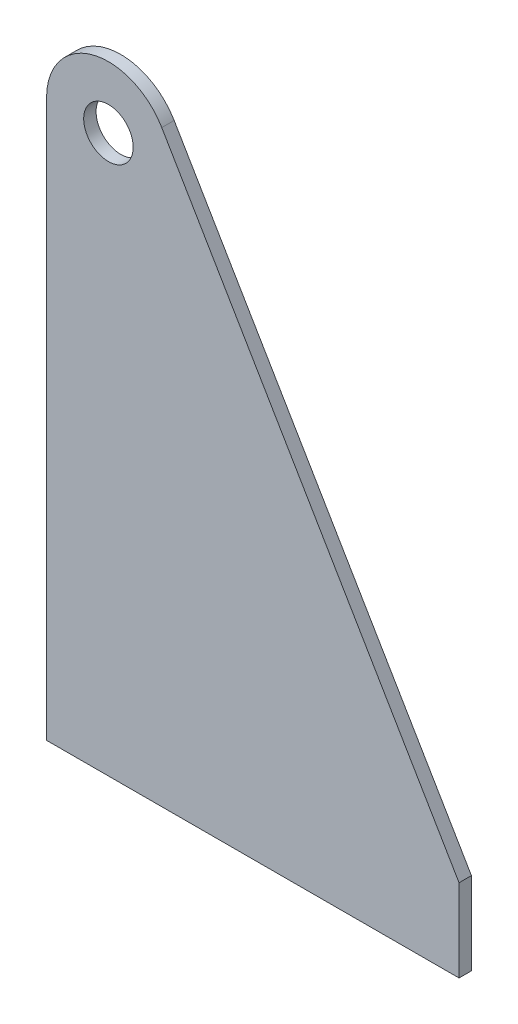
ISO-10303-21;
HEADER;
FILE_DESCRIPTION(('STEP AP214'),'2;1');
FILE_NAME('part.step','',(''),(''),'','','');
FILE_SCHEMA(('AUTOMOTIVE_DESIGN { 1 0 10303 214 1 1 1 1 }'));
ENDSEC;
DATA;
#1=APPLICATION_CONTEXT('core data for automotive mechanical design processes');
#2=APPLICATION_PROTOCOL_DEFINITION('international standard','automotive_design',2000,#1);
#3=PRODUCT_CONTEXT('',#1,'mechanical');
#4=PRODUCT('Part','Part','',(#3));
#5=PRODUCT_RELATED_PRODUCT_CATEGORY('part','',(#4));
#6=PRODUCT_DEFINITION_FORMATION('','',#4);
#7=PRODUCT_DEFINITION_CONTEXT('part definition',#1,'design');
#8=PRODUCT_DEFINITION('design','',#6,#7);
#9=PRODUCT_DEFINITION_SHAPE('','',#8);
#10=(LENGTH_UNIT() NAMED_UNIT(*) SI_UNIT(.MILLI.,.METRE.));
#11=(NAMED_UNIT(*) PLANE_ANGLE_UNIT() SI_UNIT($,.RADIAN.));
#12=(NAMED_UNIT(*) SI_UNIT($,.STERADIAN.) SOLID_ANGLE_UNIT());
#13=UNCERTAINTY_MEASURE_WITH_UNIT(LENGTH_MEASURE(1.E-05),#10,'distance_accuracy_value','');
#14=(GEOMETRIC_REPRESENTATION_CONTEXT(3) GLOBAL_UNCERTAINTY_ASSIGNED_CONTEXT((#13)) GLOBAL_UNIT_ASSIGNED_CONTEXT((#10,
#11,#12)) REPRESENTATION_CONTEXT('',''));
#15=CARTESIAN_POINT('',(0.,0.,0.));
#16=DIRECTION('',(0.,0.,1.));
#17=DIRECTION('',(1.,0.,0.));
#18=AXIS2_PLACEMENT_3D('',#15,#16,#17);
#19=CARTESIAN_POINT('',(609.61263645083,922.018228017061,3.));
#20=DIRECTION('',(0.,0.,1.));
#21=DIRECTION('',(1.,0.,0.));
#22=AXIS2_PLACEMENT_3D('',#19,#20,#21);
#23=PLANE('',#22);
#24=DIRECTION('',(-0.507040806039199,0.861922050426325,0.));
#25=VECTOR('',#24,1.);
#26=CARTESIAN_POINT('',(622.541467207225,929.623840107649,3.));
#27=LINE('',#26,#25);
#28=CARTESIAN_POINT('',(694.612578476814,807.10967702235,3.));
#29=VERTEX_POINT('',#28);
#30=CARTESIAN_POINT('',(622.541467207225,929.623840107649,3.));
#31=VERTEX_POINT('',#30);
#32=EDGE_CURVE('E102',#29,#31,#27,.T.);
#33=ORIENTED_EDGE('',*,*,#32,.T.);
#34=CARTESIAN_POINT('',(609.61263645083,922.018228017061,3.));
#35=DIRECTION('',(0.,0.,1.));
#36=DIRECTION('',(1.,0.,0.));
#37=AXIS2_PLACEMENT_3D('',#34,#35,#36);
#38=CIRCLE('',#37,15.);
#39=CARTESIAN_POINT('',(594.61263645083,922.018228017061,3.));
#40=VERTEX_POINT('',#39);
#41=EDGE_CURVE('E85',#31,#40,#38,.T.);
#42=ORIENTED_EDGE('',*,*,#41,.T.);
#43=DIRECTION('',(0.,-1.,0.));
#44=VECTOR('',#43,1.);
#45=CARTESIAN_POINT('',(594.61263645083,922.018228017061,3.));
#46=LINE('',#45,#44);
#47=CARTESIAN_POINT('',(594.61263645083,787.001997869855,3.));
#48=VERTEX_POINT('',#47);
#49=EDGE_CURVE('E105',#40,#48,#46,.T.);
#50=ORIENTED_EDGE('',*,*,#49,.T.);
#51=DIRECTION('',(0.999999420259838,0.00107679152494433,0.));
#52=VECTOR('',#51,1.);
#53=CARTESIAN_POINT('',(694.612578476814,787.10967702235,3.));
#54=LINE('',#53,#52);
#55=CARTESIAN_POINT('',(694.612578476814,787.10967702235,3.));
#56=VERTEX_POINT('',#55);
#57=EDGE_CURVE('E44',#48,#56,#54,.T.);
#58=ORIENTED_EDGE('',*,*,#57,.T.);
#59=DIRECTION('',(0.,1.,0.));
#60=VECTOR('',#59,1.);
#61=CARTESIAN_POINT('',(694.612578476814,807.10967702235,3.));
#62=LINE('',#61,#60);
#63=EDGE_CURVE('E39',#56,#29,#62,.T.);
#64=ORIENTED_EDGE('',*,*,#63,.T.);
#65=EDGE_LOOP('',(#33,#42,#50,#58,#64));
#66=FACE_BOUND('',#65,.T.);
#67=CARTESIAN_POINT('',(609.61263645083,922.018228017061,3.));
#68=DIRECTION('',(0.,0.,1.));
#69=DIRECTION('',(1.,0.,0.));
#70=AXIS2_PLACEMENT_3D('',#67,#68,#69);
#71=CIRCLE('',#70,5.99999999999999);
#72=CARTESIAN_POINT('',(615.61263645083,922.018228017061,3.));
#73=VERTEX_POINT('',#72);
#74=EDGE_CURVE('E90',#73,#73,#71,.T.);
#75=ORIENTED_EDGE('',*,*,#74,.F.);
#76=EDGE_LOOP('',(#75));
#77=FACE_BOUND('',#76,.T.);
#78=ADVANCED_FACE('F24',(#66,#77),#23,.T.);
#79=CARTESIAN_POINT('',(609.61263645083,922.018228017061,0.));
#80=DIRECTION('',(0.,0.,1.));
#81=DIRECTION('',(1.,0.,0.));
#82=AXIS2_PLACEMENT_3D('',#79,#80,#81);
#83=PLANE('',#82);
#84=DIRECTION('',(-0.507040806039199,0.861922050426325,0.));
#85=VECTOR('',#84,1.);
#86=CARTESIAN_POINT('',(622.541467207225,929.623840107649,0.));
#87=LINE('',#86,#85);
#88=CARTESIAN_POINT('',(694.612578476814,807.10967702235,0.));
#89=VERTEX_POINT('',#88);
#90=CARTESIAN_POINT('',(622.541467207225,929.623840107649,0.));
#91=VERTEX_POINT('',#90);
#92=EDGE_CURVE('E76',#89,#91,#87,.T.);
#93=ORIENTED_EDGE('',*,*,#92,.F.);
#94=DIRECTION('',(0.,1.,0.));
#95=VECTOR('',#94,1.);
#96=CARTESIAN_POINT('',(694.612578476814,807.10967702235,0.));
#97=LINE('',#96,#95);
#98=CARTESIAN_POINT('',(694.612578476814,787.10967702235,0.));
#99=VERTEX_POINT('',#98);
#100=EDGE_CURVE('E100',#99,#89,#97,.T.);
#101=ORIENTED_EDGE('',*,*,#100,.F.);
#102=DIRECTION('',(0.999999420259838,0.00107679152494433,0.));
#103=VECTOR('',#102,1.);
#104=CARTESIAN_POINT('',(694.612578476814,787.10967702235,0.));
#105=LINE('',#104,#103);
#106=CARTESIAN_POINT('',(594.61263645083,787.001997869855,0.));
#107=VERTEX_POINT('',#106);
#108=EDGE_CURVE('E98',#107,#99,#105,.T.);
#109=ORIENTED_EDGE('',*,*,#108,.F.);
#110=DIRECTION('',(0.,-1.,0.));
#111=VECTOR('',#110,1.);
#112=CARTESIAN_POINT('',(594.61263645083,922.018228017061,0.));
#113=LINE('',#112,#111);
#114=CARTESIAN_POINT('',(594.61263645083,922.018228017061,0.));
#115=VERTEX_POINT('',#114);
#116=EDGE_CURVE('E78',#115,#107,#113,.T.);
#117=ORIENTED_EDGE('',*,*,#116,.F.);
#118=CARTESIAN_POINT('',(609.61263645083,922.018228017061,0.));
#119=DIRECTION('',(0.,0.,1.));
#120=DIRECTION('',(1.,0.,0.));
#121=AXIS2_PLACEMENT_3D('',#118,#119,#120);
#122=CIRCLE('',#121,15.);
#123=EDGE_CURVE('E71',#91,#115,#122,.T.);
#124=ORIENTED_EDGE('',*,*,#123,.F.);
#125=EDGE_LOOP('',(#93,#101,#109,#117,#124));
#126=FACE_BOUND('',#125,.T.);
#127=CARTESIAN_POINT('',(609.61263645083,922.018228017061,0.));
#128=DIRECTION('',(0.,0.,1.));
#129=DIRECTION('',(1.,0.,0.));
#130=AXIS2_PLACEMENT_3D('',#127,#128,#129);
#131=CIRCLE('',#130,5.99999999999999);
#132=CARTESIAN_POINT('',(615.61263645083,922.018228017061,0.));
#133=VERTEX_POINT('',#132);
#134=EDGE_CURVE('E93',#133,#133,#131,.T.);
#135=ORIENTED_EDGE('',*,*,#134,.T.);
#136=EDGE_LOOP('',(#135));
#137=FACE_BOUND('',#136,.T.);
#138=ADVANCED_FACE('F72',(#126,#137),#83,.F.);
#139=CARTESIAN_POINT('',(622.541467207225,929.623840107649,3.));
#140=DIRECTION('',(-0.861922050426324,-0.507040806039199,0.));
#141=DIRECTION('',(0.507040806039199,-0.861922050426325,0.));
#142=AXIS2_PLACEMENT_3D('',#139,#140,#141);
#143=PLANE('',#142);
#144=ORIENTED_EDGE('',*,*,#92,.T.);
#145=DIRECTION('',(0.,0.,-1.));
#146=VECTOR('',#145,1.);
#147=CARTESIAN_POINT('',(622.541467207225,929.623840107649,3.));
#148=LINE('',#147,#146);
#149=EDGE_CURVE('E11',#31,#91,#148,.T.);
#150=ORIENTED_EDGE('',*,*,#149,.F.);
#151=ORIENTED_EDGE('',*,*,#32,.F.);
#152=DIRECTION('',(0.,0.,-1.));
#153=VECTOR('',#152,1.);
#154=CARTESIAN_POINT('',(694.612578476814,807.10967702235,3.));
#155=LINE('',#154,#153);
#156=EDGE_CURVE('E89',#29,#89,#155,.T.);
#157=ORIENTED_EDGE('',*,*,#156,.T.);
#158=EDGE_LOOP('',(#144,#150,#151,#157));
#159=FACE_BOUND('',#158,.T.);
#160=ADVANCED_FACE('F26',(#159),#143,.F.);
#161=CARTESIAN_POINT('',(609.61263645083,922.018228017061,3.));
#162=DIRECTION('',(0.,0.,-1.));
#163=DIRECTION('',(-1.,0.,0.));
#164=AXIS2_PLACEMENT_3D('',#161,#162,#163);
#165=CYLINDRICAL_SURFACE('',#164,15.);
#166=ORIENTED_EDGE('',*,*,#123,.T.);
#167=DIRECTION('',(0.,0.,-1.));
#168=VECTOR('',#167,1.);
#169=CARTESIAN_POINT('',(594.61263645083,922.018228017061,3.));
#170=LINE('',#169,#168);
#171=EDGE_CURVE('E32',#40,#115,#170,.T.);
#172=ORIENTED_EDGE('',*,*,#171,.F.);
#173=ORIENTED_EDGE('',*,*,#41,.F.);
#174=ORIENTED_EDGE('',*,*,#149,.T.);
#175=EDGE_LOOP('',(#166,#172,#173,#174));
#176=FACE_BOUND('',#175,.T.);
#177=ADVANCED_FACE('F84',(#176),#165,.T.);
#178=CARTESIAN_POINT('',(594.61263645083,922.018228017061,3.));
#179=DIRECTION('',(1.,0.,0.));
#180=DIRECTION('',(0.,0.,-1.));
#181=AXIS2_PLACEMENT_3D('',#178,#179,#180);
#182=PLANE('',#181);
#183=ORIENTED_EDGE('',*,*,#116,.T.);
#184=DIRECTION('',(0.,0.,-1.));
#185=VECTOR('',#184,1.);
#186=CARTESIAN_POINT('',(594.61263645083,787.001997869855,3.));
#187=LINE('',#186,#185);
#188=EDGE_CURVE('E113',#48,#107,#187,.T.);
#189=ORIENTED_EDGE('',*,*,#188,.F.);
#190=ORIENTED_EDGE('',*,*,#49,.F.);
#191=ORIENTED_EDGE('',*,*,#171,.T.);
#192=EDGE_LOOP('',(#183,#189,#190,#191));
#193=FACE_BOUND('',#192,.T.);
#194=ADVANCED_FACE('F117',(#193),#182,.F.);
#195=CARTESIAN_POINT('',(694.612578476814,787.10967702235,3.));
#196=DIRECTION('',(-0.00107679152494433,0.999999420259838,0.));
#197=DIRECTION('',(-0.999999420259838,-0.00107679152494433,0.));
#198=AXIS2_PLACEMENT_3D('',#195,#196,#197);
#199=PLANE('',#198);
#200=ORIENTED_EDGE('',*,*,#108,.T.);
#201=DIRECTION('',(0.,0.,-1.));
#202=VECTOR('',#201,1.);
#203=CARTESIAN_POINT('',(694.612578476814,787.10967702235,3.));
#204=LINE('',#203,#202);
#205=EDGE_CURVE('E110',#56,#99,#204,.T.);
#206=ORIENTED_EDGE('',*,*,#205,.F.);
#207=ORIENTED_EDGE('',*,*,#57,.F.);
#208=ORIENTED_EDGE('',*,*,#188,.T.);
#209=EDGE_LOOP('',(#200,#206,#207,#208));
#210=FACE_BOUND('',#209,.T.);
#211=ADVANCED_FACE('F139',(#210),#199,.F.);
#212=CARTESIAN_POINT('',(694.612578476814,807.10967702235,3.));
#213=DIRECTION('',(-1.,0.,0.));
#214=DIRECTION('',(0.,-1.,0.));
#215=AXIS2_PLACEMENT_3D('',#212,#213,#214);
#216=PLANE('',#215);
#217=ORIENTED_EDGE('',*,*,#100,.T.);
#218=ORIENTED_EDGE('',*,*,#156,.F.);
#219=ORIENTED_EDGE('',*,*,#63,.F.);
#220=ORIENTED_EDGE('',*,*,#205,.T.);
#221=EDGE_LOOP('',(#217,#218,#219,#220));
#222=FACE_BOUND('',#221,.T.);
#223=ADVANCED_FACE('F127',(#222),#216,.F.);
#224=CARTESIAN_POINT('',(609.61263645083,922.018228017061,3.));
#225=DIRECTION('',(0.,0.,-1.));
#226=DIRECTION('',(-1.,0.,0.));
#227=AXIS2_PLACEMENT_3D('',#224,#225,#226);
#228=CYLINDRICAL_SURFACE('',#227,5.99999999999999);
#229=ORIENTED_EDGE('',*,*,#74,.T.);
#230=EDGE_LOOP('',(#229));
#231=FACE_BOUND('',#230,.T.);
#232=ORIENTED_EDGE('',*,*,#134,.F.);
#233=EDGE_LOOP('',(#232));
#234=FACE_BOUND('',#233,.T.);
#235=ADVANCED_FACE('F124',(#231,#234),#228,.F.);
#236=CLOSED_SHELL('',(#78,#138,#160,#177,#194,#211,#223,#235));
#237=MANIFOLD_SOLID_BREP('B2',#236);
#238=ADVANCED_BREP_SHAPE_REPRESENTATION('',(#18,#237),#14);
#239=SHAPE_DEFINITION_REPRESENTATION(#9,#238);
ENDSEC;
END-ISO-10303-21;
